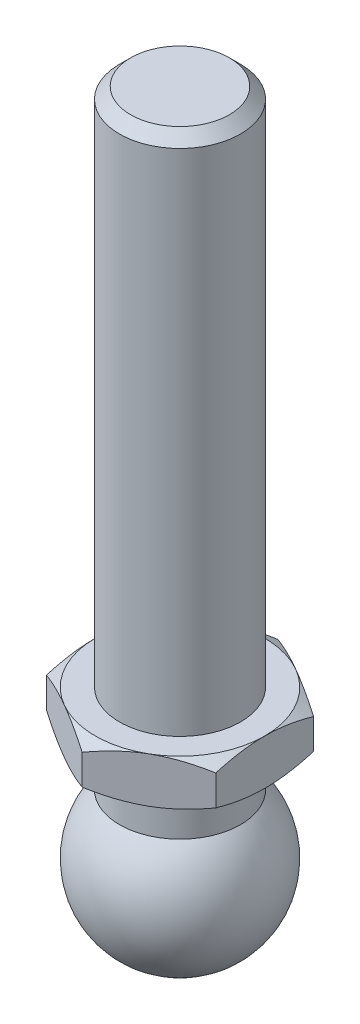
ISO-10303-21;
HEADER;
FILE_DESCRIPTION(('STEP AP214'),'2;1');
FILE_NAME('part.step','',(''),(''),'','','');
FILE_SCHEMA(('AUTOMOTIVE_DESIGN { 1 0 10303 214 1 1 1 1 }'));
ENDSEC;
DATA;
#1=APPLICATION_CONTEXT('core data for automotive mechanical design processes');
#2=APPLICATION_PROTOCOL_DEFINITION('international standard','automotive_design',2000,#1);
#3=PRODUCT_CONTEXT('',#1,'mechanical');
#4=PRODUCT('Part','Part','',(#3));
#5=PRODUCT_RELATED_PRODUCT_CATEGORY('part','',(#4));
#6=PRODUCT_DEFINITION_FORMATION('','',#4);
#7=PRODUCT_DEFINITION_CONTEXT('part definition',#1,'design');
#8=PRODUCT_DEFINITION('design','',#6,#7);
#9=PRODUCT_DEFINITION_SHAPE('','',#8);
#10=(LENGTH_UNIT() NAMED_UNIT(*) SI_UNIT(.MILLI.,.METRE.));
#11=(NAMED_UNIT(*) PLANE_ANGLE_UNIT() SI_UNIT($,.RADIAN.));
#12=(NAMED_UNIT(*) SI_UNIT($,.STERADIAN.) SOLID_ANGLE_UNIT());
#13=UNCERTAINTY_MEASURE_WITH_UNIT(LENGTH_MEASURE(1.E-05),#10,'distance_accuracy_value','');
#14=(GEOMETRIC_REPRESENTATION_CONTEXT(3) GLOBAL_UNCERTAINTY_ASSIGNED_CONTEXT((#13)) GLOBAL_UNIT_ASSIGNED_CONTEXT((#10,
#11,#12)) REPRESENTATION_CONTEXT('',''));
#15=CARTESIAN_POINT('',(0.,0.,0.));
#16=DIRECTION('',(0.,0.,1.));
#17=DIRECTION('',(1.,0.,0.));
#18=AXIS2_PLACEMENT_3D('',#15,#16,#17);
#19=CARTESIAN_POINT('',(0.,12.25,0.));
#20=DIRECTION('',(0.,-1.,0.));
#21=DIRECTION('',(0.,0.,-1.));
#22=AXIS2_PLACEMENT_3D('',#19,#20,#21);
#23=CONICAL_SURFACE('',#22,7.,1.0471975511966);
#24=CARTESIAN_POINT('',(-7.,8.18828268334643,12.1648696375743));
#25=CARTESIAN_POINT('',(-7.,8.33391573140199,11.8738003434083));
#26=CARTESIAN_POINT('',(-7.,8.47854589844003,11.5822239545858));
#27=CARTESIAN_POINT('',(-7.,8.76531569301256,10.997825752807));
#28=CARTESIAN_POINT('',(-7.,8.90745515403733,10.7050038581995));
#29=CARTESIAN_POINT('',(-7.,9.18902214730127,10.117331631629));
#30=CARTESIAN_POINT('',(-7.,9.32844364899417,9.8224784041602));
#31=CARTESIAN_POINT('',(-7.,9.60360604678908,9.23106328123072));
#32=CARTESIAN_POINT('',(-7.,9.73934701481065,8.93450141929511));
#33=CARTESIAN_POINT('',(-7.,10.0123110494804,8.32593520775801));
#34=CARTESIAN_POINT('',(-7.,10.1493254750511,8.0138369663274));
#35=CARTESIAN_POINT('',(-7.,10.4171383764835,7.38695797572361));
#36=CARTESIAN_POINT('',(-7.,10.5479365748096,7.07217710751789));
#37=CARTESIAN_POINT('',(-7.,10.8015530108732,6.43962449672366));
#38=CARTESIAN_POINT('',(-7.,10.924376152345,6.12185473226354));
#39=CARTESIAN_POINT('',(-7.,11.1599016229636,5.4826031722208));
#40=CARTESIAN_POINT('',(-7.,11.2726050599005,5.16112178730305));
#41=CARTESIAN_POINT('',(-7.,11.5099014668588,4.43821731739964));
#42=CARTESIAN_POINT('',(-7.,11.631118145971,4.03566892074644));
#43=CARTESIAN_POINT('',(-7.,11.8469740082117,3.22331060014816));
#44=CARTESIAN_POINT('',(-7.,11.9416155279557,2.81350131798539));
#45=CARTESIAN_POINT('',(-7.,12.0569999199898,2.1974256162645));
#46=CARTESIAN_POINT('',(-7.,12.0908518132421,1.99359214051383));
#47=CARTESIAN_POINT('',(-7.,12.1493191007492,1.58461613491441));
#48=CARTESIAN_POINT('',(-7.,12.1739358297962,1.37947379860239));
#49=CARTESIAN_POINT('',(-7.,12.2131968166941,0.968289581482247));
#50=CARTESIAN_POINT('',(-7.,12.2278439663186,0.762247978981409));
#51=CARTESIAN_POINT('',(-7.,12.2467021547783,0.349683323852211));
#52=CARTESIAN_POINT('',(-7.,12.2509132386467,0.143160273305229));
#53=CARTESIAN_POINT('',(-7.,12.2487493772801,-0.271082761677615));
#54=CARTESIAN_POINT('',(-7.,12.2423100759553,-0.47880240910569));
#55=CARTESIAN_POINT('',(-7.,12.2189433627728,-0.893645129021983));
#56=CARTESIAN_POINT('',(-7.,12.2020159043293,-1.10076819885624));
#57=CARTESIAN_POINT('',(-7.,12.1582124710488,-1.5140304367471));
#58=CARTESIAN_POINT('',(-7.,12.1313327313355,-1.72016920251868));
#59=CARTESIAN_POINT('',(-7.,12.0684180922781,-2.13103319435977));
#60=CARTESIAN_POINT('',(-7.,12.0323828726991,-2.33575837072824));
#61=CARTESIAN_POINT('',(-7.,11.9105686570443,-2.95437912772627));
#62=CARTESIAN_POINT('',(-7.,11.8118729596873,-3.36575077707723));
#63=CARTESIAN_POINT('',(-7.,11.5884533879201,-4.18138012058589));
#64=CARTESIAN_POINT('',(-7.,11.4637148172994,-4.58563365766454));
#65=CARTESIAN_POINT('',(-7.,11.2233248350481,-5.30320893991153));
#66=CARTESIAN_POINT('',(-7.,11.1112875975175,-5.6177595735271));
#67=CARTESIAN_POINT('',(-7.,10.8778514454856,-6.24325021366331));
#68=CARTESIAN_POINT('',(-7.,10.7564551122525,-6.55419118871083));
#69=CARTESIAN_POINT('',(-7.,10.5062070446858,-7.17328528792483));
#70=CARTESIAN_POINT('',(-7.,10.3773503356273,-7.48143638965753));
#71=CARTESIAN_POINT('',(-7.,10.1137823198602,-8.09523802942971));
#72=CARTESIAN_POINT('',(-7.,9.97907065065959,-8.40088841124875));
#73=CARTESIAN_POINT('',(-7.,9.71078407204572,-8.99716345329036));
#74=CARTESIAN_POINT('',(-7.,9.57740317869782,-9.2878756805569));
#75=CARTESIAN_POINT('',(-7.,9.30714715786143,-9.86766295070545));
#76=CARTESIAN_POINT('',(-7.,9.17027208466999,-10.1567380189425));
#77=CARTESIAN_POINT('',(-7.,8.89389786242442,-10.7329937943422));
#78=CARTESIAN_POINT('',(-7.,8.75440383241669,-11.0201769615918));
#79=CARTESIAN_POINT('',(-7.,8.47302286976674,-11.5933594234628));
#80=CARTESIAN_POINT('',(-7.,8.33113600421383,-11.879358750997));
#81=CARTESIAN_POINT('',(-7.,8.18828268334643,-12.1648696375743));
#82=B_SPLINE_CURVE_WITH_KNOTS('',3,(#24,#25,#26,#27,#28,#29,#30,#31,#32,#33,#34,#35,#36,#37,#38,
#39,#40,#41,#42,#43,#44,#45,#46,#47,#48,#49,#50,#51,#52,#53,#54,#55,#56,#57,#58,#59,#60,#61,#62,
#63,#64,#65,#66,#67,#68,#69,#70,#71,#72,#73,#74,#75,#76,#77,#78,#79,#80,#81),.UNSPECIFIED.,.F.,
.F.,(4,2,2,2,2,2,2,2,2,2,2,2,2,2,2,2,2,2,2,2,2,2,2,2,2,2,2,2,4),(0.,0.976413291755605,
1.95289161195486,2.93133423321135,3.90975772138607,4.93225217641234,5.95479223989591,
6.97669748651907,7.99849072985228,9.25906449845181,10.5195273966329,11.1392271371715,
11.7588372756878,12.3782676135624,12.9976952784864,13.6208795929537,14.2440666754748,
14.8674897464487,15.490934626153,16.7587972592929,18.027377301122,19.0289263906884,
20.0302002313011,21.0321496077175,22.0341611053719,22.9936838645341,23.9531917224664,
24.9109871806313,25.8687558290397),.UNSPECIFIED.);
#83=CARTESIAN_POINT('',(-7.,11.6247852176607,4.04145188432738));
#84=VERTEX_POINT('',#83);
#85=CARTESIAN_POINT('',(-7.,12.25,0.));
#86=VERTEX_POINT('',#85);
#87=EDGE_CURVE('E312',#84,#86,#82,.T.);
#88=ORIENTED_EDGE('',*,*,#87,.F.);
#89=CARTESIAN_POINT('',(0.0002,11.6247185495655,8.0830192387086));
#90=CARTESIAN_POINT('',(-0.153667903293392,11.6760001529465,7.99418356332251));
#91=CARTESIAN_POINT('',(-0.30810950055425,11.7249544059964,7.90501666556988));
#92=CARTESIAN_POINT('',(-0.618246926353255,11.8175672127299,7.72595873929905));
#93=CARTESIAN_POINT('',(-0.773943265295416,11.8612234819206,7.63606741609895));
#94=CARTESIAN_POINT('',(-1.24352516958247,11.9833884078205,7.36495417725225));
#95=CARTESIAN_POINT('',(-1.5592643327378,12.052874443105,7.18266208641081));
#96=CARTESIAN_POINT('',(-2.03176224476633,12.1343550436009,6.9098652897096));
#97=CARTESIAN_POINT('',(-2.18710922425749,12.1575665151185,6.82017566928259));
#98=CARTESIAN_POINT('',(-2.49850511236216,12.1964887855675,6.64039116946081));
#99=CARTESIAN_POINT('',(-2.65455395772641,12.2122002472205,6.55029632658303));
#100=CARTESIAN_POINT('',(-2.96692267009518,12.2357220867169,6.36995016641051));
#101=CARTESIAN_POINT('',(-3.12324202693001,12.2435414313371,6.27969914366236));
#102=CARTESIAN_POINT('',(-3.43601650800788,12.2511197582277,6.09911871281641));
#103=CARTESIAN_POINT('',(-3.59247162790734,12.250878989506,6.00878930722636));
#104=CARTESIAN_POINT('',(-4.02110687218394,12.2391402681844,5.76131663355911));
#105=CARTESIAN_POINT('',(-4.2931466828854,12.2194342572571,5.60425437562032));
#106=CARTESIAN_POINT('',(-4.8354194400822,12.1569465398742,5.29117305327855));
#107=CARTESIAN_POINT('',(-5.10565047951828,12.114143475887,5.13515508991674));
#108=CARTESIAN_POINT('',(-5.64901454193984,12.0071483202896,4.82144370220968));
#109=CARTESIAN_POINT('',(-5.92207900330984,11.9425029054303,4.66378986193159));
#110=CARTESIAN_POINT('',(-6.46413578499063,11.795783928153,4.35083323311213));
#111=CARTESIAN_POINT('',(-6.73313504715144,11.7137448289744,4.19552643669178));
#112=CARTESIAN_POINT('',(-7.0002,11.6247185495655,4.04133641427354));
#113=B_SPLINE_CURVE_WITH_KNOTS('',3,(#89,#90,#91,#92,#93,#94,#95,#96,#97,#98,#99,#100,#101,#102,
#103,#104,#105,#106,#107,#108,#109,#110,#111,#112),.UNSPECIFIED.,.F.,.F.,(4,2,2,2,2,2,2,2,2,2,2,
4),(0.,0.554727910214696,1.10969417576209,2.2219327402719,2.76443041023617,3.30688013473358,
3.8487128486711,4.3905288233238,5.33376515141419,6.27787517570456,7.2429241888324,
8.20607866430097),.UNSPECIFIED.);
#114=CARTESIAN_POINT('',(-3.5,12.25,6.06217782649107));
#115=VERTEX_POINT('',#114);
#116=EDGE_CURVE('E138',#115,#84,#113,.T.);
#117=ORIENTED_EDGE('',*,*,#116,.F.);
#118=CARTESIAN_POINT('',(0.,12.25,0.));
#119=DIRECTION('',(0.,-1.,0.));
#120=DIRECTION('',(0.,0.,-1.));
#121=AXIS2_PLACEMENT_3D('',#118,#119,#120);
#122=CIRCLE('',#121,7.);
#123=EDGE_CURVE('E286',#115,#86,#122,.T.);
#124=ORIENTED_EDGE('',*,*,#123,.T.);
#125=EDGE_LOOP('',(#88,#117,#124));
#126=FACE_BOUND('',#125,.T.);
#127=ADVANCED_FACE('F17',(#126),#23,.T.);
#128=CARTESIAN_POINT('',(-7.,11.6247852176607,-4.04145188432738));
#129=VERTEX_POINT('',#128);
#130=EDGE_CURVE('E196',#86,#129,#82,.T.);
#131=ORIENTED_EDGE('',*,*,#130,.F.);
#132=CARTESIAN_POINT('',(-3.5,12.25,-6.06217782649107));
#133=VERTEX_POINT('',#132);
#134=EDGE_CURVE('E198',#86,#133,#122,.T.);
#135=ORIENTED_EDGE('',*,*,#134,.T.);
#136=CARTESIAN_POINT('',(-7.0002,11.6247185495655,-4.04133641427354));
#137=CARTESIAN_POINT('',(-6.84633209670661,11.6760001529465,-4.13017208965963));
#138=CARTESIAN_POINT('',(-6.69189049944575,11.7249544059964,-4.21933898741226));
#139=CARTESIAN_POINT('',(-6.38175307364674,11.8175672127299,-4.39839691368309));
#140=CARTESIAN_POINT('',(-6.22605673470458,11.8612234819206,-4.48828823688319));
#141=CARTESIAN_POINT('',(-5.75647483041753,11.9833884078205,-4.75940147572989));
#142=CARTESIAN_POINT('',(-5.4407356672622,12.052874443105,-4.94169356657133));
#143=CARTESIAN_POINT('',(-4.96823775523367,12.1343550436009,-5.21449036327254));
#144=CARTESIAN_POINT('',(-4.81289077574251,12.1575665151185,-5.30417998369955));
#145=CARTESIAN_POINT('',(-4.50149488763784,12.1964887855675,-5.48396448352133));
#146=CARTESIAN_POINT('',(-4.34544604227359,12.2122002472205,-5.57405932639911));
#147=CARTESIAN_POINT('',(-4.03307732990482,12.2357220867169,-5.75440548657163));
#148=CARTESIAN_POINT('',(-3.87675797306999,12.2435414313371,-5.84465650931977));
#149=CARTESIAN_POINT('',(-3.56398349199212,12.2511197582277,-6.02523694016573));
#150=CARTESIAN_POINT('',(-3.40752837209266,12.250878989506,-6.11556634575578));
#151=CARTESIAN_POINT('',(-2.97889312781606,12.2391402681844,-6.36303901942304));
#152=CARTESIAN_POINT('',(-2.7068533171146,12.2194342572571,-6.52010127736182));
#153=CARTESIAN_POINT('',(-2.1645805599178,12.1569465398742,-6.83318259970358));
#154=CARTESIAN_POINT('',(-1.89434952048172,12.114143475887,-6.9892005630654));
#155=CARTESIAN_POINT('',(-1.35098545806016,12.0071483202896,-7.30291195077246));
#156=CARTESIAN_POINT('',(-1.07792099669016,11.9425029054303,-7.46056579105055));
#157=CARTESIAN_POINT('',(-0.53586421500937,11.795783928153,-7.77352241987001));
#158=CARTESIAN_POINT('',(-0.266864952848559,11.7137448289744,-7.92882921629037));
#159=CARTESIAN_POINT('',(0.000200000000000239,11.6247185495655,-8.0830192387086));
#160=B_SPLINE_CURVE_WITH_KNOTS('',3,(#136,#137,#138,#139,#140,#141,#142,#143,#144,#145,#146,
#147,#148,#149,#150,#151,#152,#153,#154,#155,#156,#157,#158,#159),.UNSPECIFIED.,.F.,.F.,(4,2,2,
2,2,2,2,2,2,2,2,4),(0.,0.554727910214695,1.10969417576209,2.2219327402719,2.76443041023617,
3.30688013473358,3.8487128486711,4.39052882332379,5.33376515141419,6.27787517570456,
7.2429241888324,8.20607866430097),.UNSPECIFIED.);
#161=EDGE_CURVE('E186',#129,#133,#160,.T.);
#162=ORIENTED_EDGE('',*,*,#161,.F.);
#163=EDGE_LOOP('',(#131,#135,#162));
#164=FACE_BOUND('',#163,.T.);
#165=ADVANCED_FACE('F195',(#164),#23,.T.);
#166=CARTESIAN_POINT('',(0.,11.6247852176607,-8.08290376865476));
#167=VERTEX_POINT('',#166);
#168=EDGE_CURVE('E200',#133,#167,#160,.T.);
#169=ORIENTED_EDGE('',*,*,#168,.F.);
#170=CARTESIAN_POINT('',(3.5,12.25,-6.06217782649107));
#171=VERTEX_POINT('',#170);
#172=EDGE_CURVE('E296',#133,#171,#122,.T.);
#173=ORIENTED_EDGE('',*,*,#172,.T.);
#174=CARTESIAN_POINT('',(-0.0002,11.6247185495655,-8.0830192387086));
#175=CARTESIAN_POINT('',(0.153667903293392,11.6760001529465,-7.99418356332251));
#176=CARTESIAN_POINT('',(0.30810950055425,11.7249544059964,-7.90501666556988));
#177=CARTESIAN_POINT('',(0.618246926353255,11.8175672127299,-7.72595873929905));
#178=CARTESIAN_POINT('',(0.773943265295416,11.8612234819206,-7.63606741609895));
#179=CARTESIAN_POINT('',(1.24352516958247,11.9833884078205,-7.36495417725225));
#180=CARTESIAN_POINT('',(1.5592643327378,12.052874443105,-7.18266208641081));
#181=CARTESIAN_POINT('',(2.03176224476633,12.1343550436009,-6.9098652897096));
#182=CARTESIAN_POINT('',(2.18710922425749,12.1575665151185,-6.82017566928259));
#183=CARTESIAN_POINT('',(2.49850511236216,12.1964887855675,-6.64039116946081));
#184=CARTESIAN_POINT('',(2.65455395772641,12.2122002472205,-6.55029632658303));
#185=CARTESIAN_POINT('',(2.96692267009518,12.2357220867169,-6.36995016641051));
#186=CARTESIAN_POINT('',(3.12324202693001,12.2435414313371,-6.27969914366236));
#187=CARTESIAN_POINT('',(3.43601650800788,12.2511197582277,-6.09911871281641));
#188=CARTESIAN_POINT('',(3.59247162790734,12.250878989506,-6.00878930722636));
#189=CARTESIAN_POINT('',(4.02110687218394,12.2391402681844,-5.76131663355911));
#190=CARTESIAN_POINT('',(4.2931466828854,12.2194342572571,-5.60425437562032));
#191=CARTESIAN_POINT('',(4.8354194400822,12.1569465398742,-5.29117305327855));
#192=CARTESIAN_POINT('',(5.10565047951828,12.114143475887,-5.13515508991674));
#193=CARTESIAN_POINT('',(5.64901454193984,12.0071483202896,-4.82144370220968));
#194=CARTESIAN_POINT('',(5.92207900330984,11.9425029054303,-4.66378986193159));
#195=CARTESIAN_POINT('',(6.46413578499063,11.795783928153,-4.35083323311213));
#196=CARTESIAN_POINT('',(6.73313504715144,11.7137448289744,-4.19552643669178));
#197=CARTESIAN_POINT('',(7.0002,11.6247185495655,-4.04133641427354));
#198=B_SPLINE_CURVE_WITH_KNOTS('',3,(#174,#175,#176,#177,#178,#179,#180,#181,#182,#183,#184,
#185,#186,#187,#188,#189,#190,#191,#192,#193,#194,#195,#196,#197),.UNSPECIFIED.,.F.,.F.,(4,2,2,
2,2,2,2,2,2,2,2,4),(0.,0.554727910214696,1.10969417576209,2.2219327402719,2.76443041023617,
3.30688013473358,3.8487128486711,4.3905288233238,5.33376515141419,6.27787517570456,
7.2429241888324,8.20607866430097),.UNSPECIFIED.);
#199=EDGE_CURVE('E246',#167,#171,#198,.T.);
#200=ORIENTED_EDGE('',*,*,#199,.F.);
#201=EDGE_LOOP('',(#169,#173,#200));
#202=FACE_BOUND('',#201,.T.);
#203=ADVANCED_FACE('F345',(#202),#23,.T.);
#204=CARTESIAN_POINT('',(7.,11.6247852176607,-4.04145188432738));
#205=VERTEX_POINT('',#204);
#206=EDGE_CURVE('E241',#171,#205,#198,.T.);
#207=ORIENTED_EDGE('',*,*,#206,.F.);
#208=CARTESIAN_POINT('',(7.,12.25,0.));
#209=VERTEX_POINT('',#208);
#210=EDGE_CURVE('E291',#171,#209,#122,.T.);
#211=ORIENTED_EDGE('',*,*,#210,.T.);
#212=CARTESIAN_POINT('',(7.,8.18828268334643,-12.1648696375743));
#213=CARTESIAN_POINT('',(7.,8.33391573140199,-11.8738003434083));
#214=CARTESIAN_POINT('',(7.,8.47854589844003,-11.5822239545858));
#215=CARTESIAN_POINT('',(7.,8.76531569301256,-10.997825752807));
#216=CARTESIAN_POINT('',(7.,8.90745515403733,-10.7050038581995));
#217=CARTESIAN_POINT('',(7.,9.18902214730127,-10.117331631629));
#218=CARTESIAN_POINT('',(7.,9.32844364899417,-9.8224784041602));
#219=CARTESIAN_POINT('',(7.,9.60360604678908,-9.23106328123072));
#220=CARTESIAN_POINT('',(7.,9.73934701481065,-8.93450141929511));
#221=CARTESIAN_POINT('',(7.,10.0123110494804,-8.32593520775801));
#222=CARTESIAN_POINT('',(7.,10.1493254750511,-8.0138369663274));
#223=CARTESIAN_POINT('',(7.,10.4171383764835,-7.38695797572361));
#224=CARTESIAN_POINT('',(7.,10.5479365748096,-7.07217710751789));
#225=CARTESIAN_POINT('',(7.,10.8015530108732,-6.43962449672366));
#226=CARTESIAN_POINT('',(7.,10.924376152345,-6.12185473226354));
#227=CARTESIAN_POINT('',(7.,11.1599016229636,-5.4826031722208));
#228=CARTESIAN_POINT('',(7.,11.2726050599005,-5.16112178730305));
#229=CARTESIAN_POINT('',(7.,11.5099014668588,-4.43821731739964));
#230=CARTESIAN_POINT('',(7.,11.631118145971,-4.03566892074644));
#231=CARTESIAN_POINT('',(7.,11.8469740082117,-3.22331060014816));
#232=CARTESIAN_POINT('',(7.,11.9416155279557,-2.81350131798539));
#233=CARTESIAN_POINT('',(7.,12.0569999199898,-2.1974256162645));
#234=CARTESIAN_POINT('',(7.,12.0908518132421,-1.99359214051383));
#235=CARTESIAN_POINT('',(7.,12.1493191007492,-1.58461613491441));
#236=CARTESIAN_POINT('',(7.,12.1739358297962,-1.37947379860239));
#237=CARTESIAN_POINT('',(7.,12.2131968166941,-0.968289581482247));
#238=CARTESIAN_POINT('',(7.,12.2278439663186,-0.762247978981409));
#239=CARTESIAN_POINT('',(7.,12.2467021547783,-0.349683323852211));
#240=CARTESIAN_POINT('',(7.,12.2509132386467,-0.143160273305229));
#241=CARTESIAN_POINT('',(7.,12.2487493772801,0.271082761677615));
#242=CARTESIAN_POINT('',(7.,12.2423100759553,0.47880240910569));
#243=CARTESIAN_POINT('',(7.,12.2189433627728,0.893645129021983));
#244=CARTESIAN_POINT('',(7.,12.2020159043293,1.10076819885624));
#245=CARTESIAN_POINT('',(7.,12.1582124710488,1.5140304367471));
#246=CARTESIAN_POINT('',(7.,12.1313327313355,1.72016920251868));
#247=CARTESIAN_POINT('',(7.,12.0684180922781,2.13103319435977));
#248=CARTESIAN_POINT('',(7.,12.0323828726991,2.33575837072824));
#249=CARTESIAN_POINT('',(7.,11.9105686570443,2.95437912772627));
#250=CARTESIAN_POINT('',(7.,11.8118729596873,3.36575077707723));
#251=CARTESIAN_POINT('',(7.,11.5884533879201,4.18138012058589));
#252=CARTESIAN_POINT('',(7.,11.4637148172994,4.58563365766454));
#253=CARTESIAN_POINT('',(7.,11.2233248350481,5.30320893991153));
#254=CARTESIAN_POINT('',(7.,11.1112875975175,5.6177595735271));
#255=CARTESIAN_POINT('',(7.,10.8778514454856,6.24325021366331));
#256=CARTESIAN_POINT('',(7.,10.7564551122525,6.55419118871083));
#257=CARTESIAN_POINT('',(7.,10.5062070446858,7.17328528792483));
#258=CARTESIAN_POINT('',(7.,10.3773503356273,7.48143638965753));
#259=CARTESIAN_POINT('',(7.,10.1137823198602,8.09523802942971));
#260=CARTESIAN_POINT('',(7.,9.97907065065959,8.40088841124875));
#261=CARTESIAN_POINT('',(7.,9.71078407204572,8.99716345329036));
#262=CARTESIAN_POINT('',(7.,9.57740317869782,9.2878756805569));
#263=CARTESIAN_POINT('',(7.,9.30714715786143,9.86766295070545));
#264=CARTESIAN_POINT('',(7.,9.17027208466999,10.1567380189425));
#265=CARTESIAN_POINT('',(7.,8.89389786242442,10.7329937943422));
#266=CARTESIAN_POINT('',(7.,8.75440383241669,11.0201769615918));
#267=CARTESIAN_POINT('',(7.,8.47302286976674,11.5933594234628));
#268=CARTESIAN_POINT('',(7.,8.33113600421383,11.879358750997));
#269=CARTESIAN_POINT('',(7.,8.18828268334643,12.1648696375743));
#270=B_SPLINE_CURVE_WITH_KNOTS('',3,(#212,#213,#214,#215,#216,#217,#218,#219,#220,#221,#222,
#223,#224,#225,#226,#227,#228,#229,#230,#231,#232,#233,#234,#235,#236,#237,#238,#239,#240,#241,
#242,#243,#244,#245,#246,#247,#248,#249,#250,#251,#252,#253,#254,#255,#256,#257,#258,#259,#260,
#261,#262,#263,#264,#265,#266,#267,#268,#269),.UNSPECIFIED.,.F.,.F.,(4,2,2,2,2,2,2,2,2,2,2,2,2,
2,2,2,2,2,2,2,2,2,2,2,2,2,2,2,4),(0.,0.976413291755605,1.95289161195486,2.93133423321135,
3.90975772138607,4.93225217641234,5.95479223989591,6.97669748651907,7.99849072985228,
9.25906449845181,10.5195273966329,11.1392271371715,11.7588372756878,12.3782676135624,
12.9976952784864,13.6208795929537,14.2440666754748,14.8674897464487,15.490934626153,
16.7587972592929,18.027377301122,19.0289263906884,20.0302002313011,21.0321496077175,
22.0341611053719,22.9936838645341,23.9531917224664,24.9109871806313,25.8687558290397),.UNSPECIFIED.);
#271=EDGE_CURVE('E252',#205,#209,#270,.T.);
#272=ORIENTED_EDGE('',*,*,#271,.F.);
#273=EDGE_LOOP('',(#207,#211,#272));
#274=FACE_BOUND('',#273,.T.);
#275=ADVANCED_FACE('F355',(#274),#23,.T.);
#276=CARTESIAN_POINT('',(7.,11.6247852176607,4.04145188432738));
#277=VERTEX_POINT('',#276);
#278=EDGE_CURVE('E254',#209,#277,#270,.T.);
#279=ORIENTED_EDGE('',*,*,#278,.F.);
#280=CARTESIAN_POINT('',(3.5,12.25,6.06217782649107));
#281=VERTEX_POINT('',#280);
#282=EDGE_CURVE('E284',#209,#281,#122,.T.);
#283=ORIENTED_EDGE('',*,*,#282,.T.);
#284=CARTESIAN_POINT('',(7.0002,11.6247185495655,4.04133641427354));
#285=CARTESIAN_POINT('',(6.84633209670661,11.6760001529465,4.13017208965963));
#286=CARTESIAN_POINT('',(6.69189049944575,11.7249544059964,4.21933898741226));
#287=CARTESIAN_POINT('',(6.38175307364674,11.8175672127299,4.39839691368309));
#288=CARTESIAN_POINT('',(6.22605673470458,11.8612234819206,4.48828823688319));
#289=CARTESIAN_POINT('',(5.75647483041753,11.9833884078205,4.75940147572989));
#290=CARTESIAN_POINT('',(5.4407356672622,12.052874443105,4.94169356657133));
#291=CARTESIAN_POINT('',(4.96823775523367,12.1343550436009,5.21449036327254));
#292=CARTESIAN_POINT('',(4.81289077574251,12.1575665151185,5.30417998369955));
#293=CARTESIAN_POINT('',(4.50149488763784,12.1964887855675,5.48396448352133));
#294=CARTESIAN_POINT('',(4.34544604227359,12.2122002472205,5.57405932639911));
#295=CARTESIAN_POINT('',(4.03307732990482,12.2357220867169,5.75440548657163));
#296=CARTESIAN_POINT('',(3.87675797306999,12.2435414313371,5.84465650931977));
#297=CARTESIAN_POINT('',(3.56398349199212,12.2511197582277,6.02523694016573));
#298=CARTESIAN_POINT('',(3.40752837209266,12.250878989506,6.11556634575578));
#299=CARTESIAN_POINT('',(2.97889312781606,12.2391402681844,6.36303901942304));
#300=CARTESIAN_POINT('',(2.7068533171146,12.2194342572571,6.52010127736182));
#301=CARTESIAN_POINT('',(2.1645805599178,12.1569465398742,6.83318259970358));
#302=CARTESIAN_POINT('',(1.89434952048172,12.114143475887,6.9892005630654));
#303=CARTESIAN_POINT('',(1.35098545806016,12.0071483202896,7.30291195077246));
#304=CARTESIAN_POINT('',(1.07792099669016,11.9425029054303,7.46056579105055));
#305=CARTESIAN_POINT('',(0.53586421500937,11.795783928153,7.77352241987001));
#306=CARTESIAN_POINT('',(0.266864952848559,11.7137448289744,7.92882921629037));
#307=CARTESIAN_POINT('',(-0.000200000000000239,11.6247185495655,8.0830192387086));
#308=B_SPLINE_CURVE_WITH_KNOTS('',3,(#284,#285,#286,#287,#288,#289,#290,#291,#292,#293,#294,
#295,#296,#297,#298,#299,#300,#301,#302,#303,#304,#305,#306,#307),.UNSPECIFIED.,.F.,.F.,(4,2,2,
2,2,2,2,2,2,2,2,4),(0.,0.554727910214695,1.10969417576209,2.2219327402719,2.76443041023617,
3.30688013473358,3.8487128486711,4.39052882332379,5.33376515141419,6.27787517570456,
7.2429241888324,8.20607866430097),.UNSPECIFIED.);
#309=EDGE_CURVE('E129',#277,#281,#308,.T.);
#310=ORIENTED_EDGE('',*,*,#309,.F.);
#311=EDGE_LOOP('',(#279,#283,#310));
#312=FACE_BOUND('',#311,.T.);
#313=ADVANCED_FACE('F288',(#312),#23,.T.);
#314=CARTESIAN_POINT('',(0.,11.6247852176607,8.08290376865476));
#315=VERTEX_POINT('',#314);
#316=EDGE_CURVE('E119',#281,#315,#308,.T.);
#317=ORIENTED_EDGE('',*,*,#316,.F.);
#318=EDGE_CURVE('E277',#281,#115,#122,.T.);
#319=ORIENTED_EDGE('',*,*,#318,.T.);
#320=EDGE_CURVE('E32',#315,#115,#113,.T.);
#321=ORIENTED_EDGE('',*,*,#320,.F.);
#322=EDGE_LOOP('',(#317,#319,#321));
#323=FACE_BOUND('',#322,.T.);
#324=ADVANCED_FACE('F276',(#323),#23,.T.);
#325=CARTESIAN_POINT('',(0.,55.25,0.));
#326=DIRECTION('',(0.,-1.,0.));
#327=DIRECTION('',(0.,0.,-1.));
#328=AXIS2_PLACEMENT_3D('',#325,#326,#327);
#329=PLANE('',#328);
#330=CARTESIAN_POINT('',(0.,55.25,0.));
#331=DIRECTION('',(0.,-1.,0.));
#332=DIRECTION('',(0.,0.,-1.));
#333=AXIS2_PLACEMENT_3D('',#330,#331,#332);
#334=CIRCLE('',#333,4.08);
#335=CARTESIAN_POINT('',(0.,55.25,-4.08));
#336=VERTEX_POINT('',#335);
#337=EDGE_CURVE('E25',#336,#336,#334,.T.);
#338=ORIENTED_EDGE('',*,*,#337,.F.);
#339=EDGE_LOOP('',(#338));
#340=FACE_BOUND('',#339,.T.);
#341=ADVANCED_FACE('F19',(#340),#329,.F.);
#342=CARTESIAN_POINT('',(0.,55.25,0.));
#343=DIRECTION('',(0.,-1.,0.));
#344=DIRECTION('',(0.,0.,-1.));
#345=AXIS2_PLACEMENT_3D('',#342,#343,#344);
#346=CONICAL_SURFACE('',#345,4.08,0.785398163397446);
#347=CARTESIAN_POINT('',(0.,54.33,0.));
#348=DIRECTION('',(0.,-1.,0.));
#349=DIRECTION('',(0.,0.,-1.));
#350=AXIS2_PLACEMENT_3D('',#347,#348,#349);
#351=CIRCLE('',#350,5.);
#352=CARTESIAN_POINT('',(0.,54.33,-5.));
#353=VERTEX_POINT('',#352);
#354=EDGE_CURVE('E293',#353,#353,#351,.T.);
#355=ORIENTED_EDGE('',*,*,#354,.F.);
#356=EDGE_LOOP('',(#355));
#357=FACE_BOUND('',#356,.T.);
#358=ORIENTED_EDGE('',*,*,#337,.T.);
#359=EDGE_LOOP('',(#358));
#360=FACE_BOUND('',#359,.T.);
#361=ADVANCED_FACE('F353',(#357,#360),#346,.T.);
#362=CARTESIAN_POINT('',(0.,-7.,0.));
#363=DIRECTION('',(0.,-1.,0.));
#364=DIRECTION('',(0.,0.,-1.));
#365=AXIS2_PLACEMENT_3D('',#362,#363,#364);
#366=CYLINDRICAL_SURFACE('',#365,5.);
#367=CARTESIAN_POINT('',(0.,12.25,0.));
#368=DIRECTION('',(0.,-1.,0.));
#369=DIRECTION('',(0.,0.,-1.));
#370=AXIS2_PLACEMENT_3D('',#367,#368,#369);
#371=CIRCLE('',#370,5.);
#372=CARTESIAN_POINT('',(0.,12.25,-5.));
#373=VERTEX_POINT('',#372);
#374=EDGE_CURVE('E290',#373,#373,#371,.T.);
#375=ORIENTED_EDGE('',*,*,#374,.F.);
#376=EDGE_LOOP('',(#375));
#377=FACE_BOUND('',#376,.T.);
#378=ORIENTED_EDGE('',*,*,#354,.T.);
#379=EDGE_LOOP('',(#378));
#380=FACE_BOUND('',#379,.T.);
#381=ADVANCED_FACE('F430',(#377,#380),#366,.T.);
#382=CARTESIAN_POINT('',(5.,12.25,0.));
#383=DIRECTION('',(0.,-1.,0.));
#384=DIRECTION('',(0.,0.,-1.));
#385=AXIS2_PLACEMENT_3D('',#382,#383,#384);
#386=PLANE('',#385);
#387=ORIENTED_EDGE('',*,*,#282,.F.);
#388=ORIENTED_EDGE('',*,*,#210,.F.);
#389=ORIENTED_EDGE('',*,*,#172,.F.);
#390=ORIENTED_EDGE('',*,*,#134,.F.);
#391=ORIENTED_EDGE('',*,*,#123,.F.);
#392=ORIENTED_EDGE('',*,*,#318,.F.);
#393=EDGE_LOOP('',(#387,#388,#389,#390,#391,#392));
#394=FACE_BOUND('',#393,.T.);
#395=ORIENTED_EDGE('',*,*,#374,.T.);
#396=EDGE_LOOP('',(#395));
#397=FACE_BOUND('',#396,.T.);
#398=ADVANCED_FACE('F281',(#394,#397),#386,.F.);
#399=CARTESIAN_POINT('',(-7.,8.5,-4.04145188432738));
#400=DIRECTION('',(-1.,0.,0.));
#401=DIRECTION('',(0.,0.,1.));
#402=AXIS2_PLACEMENT_3D('',#399,#400,#401);
#403=PLANE('',#402);
#404=ORIENTED_EDGE('',*,*,#87,.T.);
#405=ORIENTED_EDGE('',*,*,#130,.T.);
#406=DIRECTION('',(0.,1.,0.));
#407=VECTOR('',#406,1.);
#408=CARTESIAN_POINT('',(-7.,8.5,-4.04145188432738));
#409=LINE('',#408,#407);
#410=CARTESIAN_POINT('',(-7.,9.12521478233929,-4.04145188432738));
#411=VERTEX_POINT('',#410);
#412=EDGE_CURVE('E112',#411,#129,#409,.T.);
#413=ORIENTED_EDGE('',*,*,#412,.F.);
#414=CARTESIAN_POINT('',(-7.,12.5617173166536,-12.1648696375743));
#415=CARTESIAN_POINT('',(-7.,12.416084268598,-11.8738003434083));
#416=CARTESIAN_POINT('',(-7.,12.27145410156,-11.5822239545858));
#417=CARTESIAN_POINT('',(-7.,11.9846843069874,-10.997825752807));
#418=CARTESIAN_POINT('',(-7.,11.8425448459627,-10.7050038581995));
#419=CARTESIAN_POINT('',(-7.,11.5609778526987,-10.1173316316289));
#420=CARTESIAN_POINT('',(-7.,11.4215563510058,-9.82247840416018));
#421=CARTESIAN_POINT('',(-7.,11.1463939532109,-9.23106328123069));
#422=CARTESIAN_POINT('',(-7.,11.0106529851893,-8.93450141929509));
#423=CARTESIAN_POINT('',(-7.,10.7376889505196,-8.32593520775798));
#424=CARTESIAN_POINT('',(-7.,10.6006745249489,-8.01383696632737));
#425=CARTESIAN_POINT('',(-7.,10.3328616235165,-7.38695797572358));
#426=CARTESIAN_POINT('',(-7.,10.2020634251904,-7.07217710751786));
#427=CARTESIAN_POINT('',(-7.,9.94844698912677,-6.43962449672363));
#428=CARTESIAN_POINT('',(-7.,9.825623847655,-6.12185473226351));
#429=CARTESIAN_POINT('',(-7.,9.59009837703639,-5.48260317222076));
#430=CARTESIAN_POINT('',(-7.,9.47739494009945,-5.16112178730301));
#431=CARTESIAN_POINT('',(-7.,9.24009853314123,-4.4382173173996));
#432=CARTESIAN_POINT('',(-7.,9.11888185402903,-4.03566892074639));
#433=CARTESIAN_POINT('',(-7.,8.90302599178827,-3.22331060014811));
#434=CARTESIAN_POINT('',(-7.,8.80838447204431,-2.81350131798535));
#435=CARTESIAN_POINT('',(-7.,8.69300008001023,-2.19742561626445));
#436=CARTESIAN_POINT('',(-7.,8.65914818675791,-1.99359214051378));
#437=CARTESIAN_POINT('',(-7.,8.60068089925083,-1.58461613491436));
#438=CARTESIAN_POINT('',(-7.,8.5760641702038,-1.37947379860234));
#439=CARTESIAN_POINT('',(-7.,8.53680318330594,-0.968289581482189));
#440=CARTESIAN_POINT('',(-7.,8.52215603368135,-0.76224797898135));
#441=CARTESIAN_POINT('',(-7.,8.50329784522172,-0.349683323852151));
#442=CARTESIAN_POINT('',(-7.,8.49908676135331,-0.143160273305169));
#443=CARTESIAN_POINT('',(-7.,8.50125062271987,0.271082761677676));
#444=CARTESIAN_POINT('',(-7.,8.50768992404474,0.478802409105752));
#445=CARTESIAN_POINT('',(-7.,8.53105663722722,0.893645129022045));
#446=CARTESIAN_POINT('',(-7.,8.54798409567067,1.1007681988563));
#447=CARTESIAN_POINT('',(-7.,8.59178752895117,1.51403043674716));
#448=CARTESIAN_POINT('',(-7.,8.61866726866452,1.72016920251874));
#449=CARTESIAN_POINT('',(-7.,8.68158190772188,2.13103319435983));
#450=CARTESIAN_POINT('',(-7.,8.71761712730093,2.33575837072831));
#451=CARTESIAN_POINT('',(-7.,8.83943134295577,2.95437912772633));
#452=CARTESIAN_POINT('',(-7.,8.93812704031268,3.3657507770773));
#453=CARTESIAN_POINT('',(-7.,9.16154661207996,4.18138012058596));
#454=CARTESIAN_POINT('',(-7.,9.28628518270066,4.58563365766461));
#455=CARTESIAN_POINT('',(-7.,9.52667516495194,5.30320893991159));
#456=CARTESIAN_POINT('',(-7.,9.63871240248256,5.61775957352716));
#457=CARTESIAN_POINT('',(-7.,9.87214855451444,6.24325021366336));
#458=CARTESIAN_POINT('',(-7.,9.99354488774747,6.55419118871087));
#459=CARTESIAN_POINT('',(-7.,10.2437929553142,7.17328528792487));
#460=CARTESIAN_POINT('',(-7.,10.3726496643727,7.48143638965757));
#461=CARTESIAN_POINT('',(-7.,10.6362176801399,8.09523802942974));
#462=CARTESIAN_POINT('',(-7.,10.7709293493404,8.40088841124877));
#463=CARTESIAN_POINT('',(-7.,11.0392159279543,8.99716345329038));
#464=CARTESIAN_POINT('',(-7.,11.1725968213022,9.28787568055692));
#465=CARTESIAN_POINT('',(-7.,11.4428528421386,9.86766295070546));
#466=CARTESIAN_POINT('',(-7.,11.57972791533,10.1567380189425));
#467=CARTESIAN_POINT('',(-7.,11.8561021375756,10.7329937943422));
#468=CARTESIAN_POINT('',(-7.,11.9955961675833,11.0201769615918));
#469=CARTESIAN_POINT('',(-7.,12.2769771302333,11.5933594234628));
#470=CARTESIAN_POINT('',(-7.,12.4188639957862,11.879358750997));
#471=CARTESIAN_POINT('',(-7.,12.5617173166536,12.1648696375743));
#472=B_SPLINE_CURVE_WITH_KNOTS('',3,(#414,#415,#416,#417,#418,#419,#420,#421,#422,#423,#424,
#425,#426,#427,#428,#429,#430,#431,#432,#433,#434,#435,#436,#437,#438,#439,#440,#441,#442,#443,
#444,#445,#446,#447,#448,#449,#450,#451,#452,#453,#454,#455,#456,#457,#458,#459,#460,#461,#462,
#463,#464,#465,#466,#467,#468,#469,#470,#471),.UNSPECIFIED.,.F.,.F.,(4,2,2,2,2,2,2,2,2,2,2,2,2,
2,2,2,2,2,2,2,2,2,2,2,2,2,2,2,4),(0.,0.976413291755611,1.95289161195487,2.93133423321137,
3.90975772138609,4.93225217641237,5.95479223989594,6.97669748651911,7.99849072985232,
9.25906449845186,10.5195273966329,11.1392271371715,11.7588372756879,12.3782676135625,
12.9976952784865,13.6208795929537,14.2440666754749,14.8674897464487,15.490934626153,
16.758797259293,18.0273773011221,19.0289263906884,20.0302002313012,21.0321496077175,
22.0341611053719,22.9936838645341,23.9531917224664,24.9109871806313,25.8687558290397),.UNSPECIFIED.);
#473=CARTESIAN_POINT('',(-7.,8.5,0.));
#474=VERTEX_POINT('',#473);
#475=EDGE_CURVE('E202',#411,#474,#472,.T.);
#476=ORIENTED_EDGE('',*,*,#475,.T.);
#477=CARTESIAN_POINT('',(-7.,9.12521478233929,4.04145188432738));
#478=VERTEX_POINT('',#477);
#479=EDGE_CURVE('E199',#474,#478,#472,.T.);
#480=ORIENTED_EDGE('',*,*,#479,.T.);
#481=DIRECTION('',(0.,1.,0.));
#482=VECTOR('',#481,1.);
#483=CARTESIAN_POINT('',(-7.,8.5,4.04145188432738));
#484=LINE('',#483,#482);
#485=EDGE_CURVE('E121',#478,#84,#484,.T.);
#486=ORIENTED_EDGE('',*,*,#485,.T.);
#487=EDGE_LOOP('',(#404,#405,#413,#476,#480,#486));
#488=FACE_BOUND('',#487,.T.);
#489=ADVANCED_FACE('F227',(#488),#403,.T.);
#490=CARTESIAN_POINT('',(0.,8.5,-8.08290376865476));
#491=DIRECTION('',(-0.5,0.,-0.866025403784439));
#492=DIRECTION('',(-0.866025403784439,0.,0.5));
#493=AXIS2_PLACEMENT_3D('',#490,#491,#492);
#494=PLANE('',#493);
#495=ORIENTED_EDGE('',*,*,#161,.T.);
#496=ORIENTED_EDGE('',*,*,#168,.T.);
#497=DIRECTION('',(0.,1.,0.));
#498=VECTOR('',#497,1.);
#499=CARTESIAN_POINT('',(0.,8.5,-8.08290376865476));
#500=LINE('',#499,#498);
#501=CARTESIAN_POINT('',(0.,9.12521478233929,-8.08290376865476));
#502=VERTEX_POINT('',#501);
#503=EDGE_CURVE('E178',#502,#167,#500,.T.);
#504=ORIENTED_EDGE('',*,*,#503,.F.);
#505=CARTESIAN_POINT('',(0.0002,9.1252814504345,-8.0830192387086));
#506=CARTESIAN_POINT('',(-0.153667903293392,9.07399984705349,-7.99418356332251));
#507=CARTESIAN_POINT('',(-0.308109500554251,9.02504559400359,-7.90501666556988));
#508=CARTESIAN_POINT('',(-0.618246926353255,8.93243278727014,-7.72595873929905));
#509=CARTESIAN_POINT('',(-0.773943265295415,8.88877651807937,-7.63606741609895));
#510=CARTESIAN_POINT('',(-1.24352516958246,8.7666115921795,-7.36495417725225));
#511=CARTESIAN_POINT('',(-1.5592643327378,8.69712555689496,-7.18266208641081));
#512=CARTESIAN_POINT('',(-2.03176224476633,8.6156449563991,-6.9098652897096));
#513=CARTESIAN_POINT('',(-2.18710922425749,8.59243348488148,-6.82017566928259));
#514=CARTESIAN_POINT('',(-2.49850511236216,8.55351121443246,-6.64039116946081));
#515=CARTESIAN_POINT('',(-2.65455395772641,8.53779975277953,-6.55029632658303));
#516=CARTESIAN_POINT('',(-2.96692267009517,8.51427791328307,-6.36995016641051));
#517=CARTESIAN_POINT('',(-3.12324202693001,8.50645856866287,-6.27969914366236));
#518=CARTESIAN_POINT('',(-3.43601650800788,8.49888024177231,-6.09911871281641));
#519=CARTESIAN_POINT('',(-3.59247162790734,8.49912101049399,-6.00878930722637));
#520=CARTESIAN_POINT('',(-4.02110687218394,8.5108597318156,-5.76131663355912));
#521=CARTESIAN_POINT('',(-4.2931466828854,8.53056574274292,-5.60425437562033));
#522=CARTESIAN_POINT('',(-4.83541944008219,8.59305346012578,-5.29117305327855));
#523=CARTESIAN_POINT('',(-5.10565047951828,8.63585652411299,-5.13515508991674));
#524=CARTESIAN_POINT('',(-5.64901454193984,8.74285167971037,-4.82144370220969));
#525=CARTESIAN_POINT('',(-5.92207900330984,8.80749709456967,-4.66378986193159));
#526=CARTESIAN_POINT('',(-6.46413578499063,8.95421607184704,-4.35083323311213));
#527=CARTESIAN_POINT('',(-6.73313504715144,9.03625517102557,-4.19552643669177));
#528=CARTESIAN_POINT('',(-7.0002,9.1252814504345,-4.04133641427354));
#529=B_SPLINE_CURVE_WITH_KNOTS('',3,(#505,#506,#507,#508,#509,#510,#511,#512,#513,#514,#515,
#516,#517,#518,#519,#520,#521,#522,#523,#524,#525,#526,#527,#528),.UNSPECIFIED.,.F.,.F.,(4,2,2,
2,2,2,2,2,2,2,2,4),(0.,0.554727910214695,1.10969417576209,2.2219327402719,2.76443041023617,
3.30688013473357,3.8487128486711,4.39052882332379,5.33376515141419,6.27787517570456,
7.2429241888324,8.20607866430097),.UNSPECIFIED.);
#530=CARTESIAN_POINT('',(-3.5,8.5,-6.06217782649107));
#531=VERTEX_POINT('',#530);
#532=EDGE_CURVE('E204',#502,#531,#529,.T.);
#533=ORIENTED_EDGE('',*,*,#532,.T.);
#534=EDGE_CURVE('E189',#531,#411,#529,.T.);
#535=ORIENTED_EDGE('',*,*,#534,.T.);
#536=ORIENTED_EDGE('',*,*,#412,.T.);
#537=EDGE_LOOP('',(#495,#496,#504,#533,#535,#536));
#538=FACE_BOUND('',#537,.T.);
#539=ADVANCED_FACE('F185',(#538),#494,.T.);
#540=CARTESIAN_POINT('',(7.,8.5,-4.04145188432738));
#541=DIRECTION('',(0.5,0.,-0.866025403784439));
#542=DIRECTION('',(-0.866025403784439,0.,-0.5));
#543=AXIS2_PLACEMENT_3D('',#540,#541,#542);
#544=PLANE('',#543);
#545=ORIENTED_EDGE('',*,*,#199,.T.);
#546=ORIENTED_EDGE('',*,*,#206,.T.);
#547=DIRECTION('',(0.,1.,0.));
#548=VECTOR('',#547,1.);
#549=CARTESIAN_POINT('',(7.,8.5,-4.04145188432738));
#550=LINE('',#549,#548);
#551=CARTESIAN_POINT('',(7.,9.12521478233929,-4.04145188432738));
#552=VERTEX_POINT('',#551);
#553=EDGE_CURVE('E175',#552,#205,#550,.T.);
#554=ORIENTED_EDGE('',*,*,#553,.F.);
#555=CARTESIAN_POINT('',(7.0002,9.1252814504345,-4.04133641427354));
#556=CARTESIAN_POINT('',(6.84633209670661,9.07399984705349,-4.13017208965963));
#557=CARTESIAN_POINT('',(6.69189049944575,9.02504559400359,-4.21933898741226));
#558=CARTESIAN_POINT('',(6.38175307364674,8.93243278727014,-4.39839691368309));
#559=CARTESIAN_POINT('',(6.22605673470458,8.88877651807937,-4.48828823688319));
#560=CARTESIAN_POINT('',(5.75647483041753,8.7666115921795,-4.75940147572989));
#561=CARTESIAN_POINT('',(5.4407356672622,8.69712555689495,-4.94169356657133));
#562=CARTESIAN_POINT('',(4.96823775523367,8.6156449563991,-5.21449036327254));
#563=CARTESIAN_POINT('',(4.81289077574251,8.59243348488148,-5.30417998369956));
#564=CARTESIAN_POINT('',(4.50149488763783,8.55351121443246,-5.48396448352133));
#565=CARTESIAN_POINT('',(4.34544604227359,8.53779975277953,-5.57405932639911));
#566=CARTESIAN_POINT('',(4.03307732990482,8.51427791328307,-5.75440548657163));
#567=CARTESIAN_POINT('',(3.87675797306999,8.50645856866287,-5.84465650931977));
#568=CARTESIAN_POINT('',(3.56398349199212,8.49888024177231,-6.02523694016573));
#569=CARTESIAN_POINT('',(3.40752837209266,8.49912101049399,-6.11556634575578));
#570=CARTESIAN_POINT('',(2.97889312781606,8.5108597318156,-6.36303901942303));
#571=CARTESIAN_POINT('',(2.7068533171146,8.53056574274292,-6.52010127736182));
#572=CARTESIAN_POINT('',(2.1645805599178,8.59305346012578,-6.83318259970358));
#573=CARTESIAN_POINT('',(1.89434952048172,8.63585652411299,-6.9892005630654));
#574=CARTESIAN_POINT('',(1.35098545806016,8.74285167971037,-7.30291195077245));
#575=CARTESIAN_POINT('',(1.07792099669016,8.80749709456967,-7.46056579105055));
#576=CARTESIAN_POINT('',(0.535864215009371,8.95421607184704,-7.77352241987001));
#577=CARTESIAN_POINT('',(0.26686495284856,9.03625517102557,-7.92882921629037));
#578=CARTESIAN_POINT('',(-0.000200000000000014,9.1252814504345,-8.0830192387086));
#579=B_SPLINE_CURVE_WITH_KNOTS('',3,(#555,#556,#557,#558,#559,#560,#561,#562,#563,#564,#565,
#566,#567,#568,#569,#570,#571,#572,#573,#574,#575,#576,#577,#578),.UNSPECIFIED.,.F.,.F.,(4,2,2,
2,2,2,2,2,2,2,2,4),(0.,0.554727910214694,1.10969417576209,2.2219327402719,2.76443041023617,
3.30688013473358,3.8487128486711,4.39052882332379,5.33376515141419,6.27787517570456,
7.2429241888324,8.20607866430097),.UNSPECIFIED.);
#580=CARTESIAN_POINT('',(3.5,8.5,-6.06217782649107));
#581=VERTEX_POINT('',#580);
#582=EDGE_CURVE('E247',#552,#581,#579,.T.);
#583=ORIENTED_EDGE('',*,*,#582,.T.);
#584=EDGE_CURVE('E235',#581,#502,#579,.T.);
#585=ORIENTED_EDGE('',*,*,#584,.T.);
#586=ORIENTED_EDGE('',*,*,#503,.T.);
#587=EDGE_LOOP('',(#545,#546,#554,#583,#585,#586));
#588=FACE_BOUND('',#587,.T.);
#589=ADVANCED_FACE('F226',(#588),#544,.T.);
#590=CARTESIAN_POINT('',(7.,8.5,4.04145188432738));
#591=DIRECTION('',(1.,0.,0.));
#592=DIRECTION('',(0.,0.,-1.));
#593=AXIS2_PLACEMENT_3D('',#590,#591,#592);
#594=PLANE('',#593);
#595=ORIENTED_EDGE('',*,*,#271,.T.);
#596=ORIENTED_EDGE('',*,*,#278,.T.);
#597=DIRECTION('',(0.,1.,0.));
#598=VECTOR('',#597,1.);
#599=CARTESIAN_POINT('',(7.,8.5,4.04145188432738));
#600=LINE('',#599,#598);
#601=CARTESIAN_POINT('',(7.,9.12521478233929,4.04145188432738));
#602=VERTEX_POINT('',#601);
#603=EDGE_CURVE('E120',#602,#277,#600,.T.);
#604=ORIENTED_EDGE('',*,*,#603,.F.);
#605=CARTESIAN_POINT('',(7.,12.5617173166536,12.1648696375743));
#606=CARTESIAN_POINT('',(7.,12.416084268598,11.8738003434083));
#607=CARTESIAN_POINT('',(7.,12.27145410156,11.5822239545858));
#608=CARTESIAN_POINT('',(7.,11.9846843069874,10.997825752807));
#609=CARTESIAN_POINT('',(7.,11.8425448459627,10.7050038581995));
#610=CARTESIAN_POINT('',(7.,11.5609778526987,10.1173316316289));
#611=CARTESIAN_POINT('',(7.,11.4215563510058,9.82247840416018));
#612=CARTESIAN_POINT('',(7.,11.1463939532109,9.23106328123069));
#613=CARTESIAN_POINT('',(7.,11.0106529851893,8.93450141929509));
#614=CARTESIAN_POINT('',(7.,10.7376889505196,8.32593520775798));
#615=CARTESIAN_POINT('',(7.,10.6006745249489,8.01383696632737));
#616=CARTESIAN_POINT('',(7.,10.3328616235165,7.38695797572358));
#617=CARTESIAN_POINT('',(7.,10.2020634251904,7.07217710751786));
#618=CARTESIAN_POINT('',(7.,9.94844698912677,6.43962449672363));
#619=CARTESIAN_POINT('',(7.,9.825623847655,6.12185473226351));
#620=CARTESIAN_POINT('',(7.,9.59009837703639,5.48260317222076));
#621=CARTESIAN_POINT('',(7.,9.47739494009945,5.16112178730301));
#622=CARTESIAN_POINT('',(7.,9.24009853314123,4.4382173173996));
#623=CARTESIAN_POINT('',(7.,9.11888185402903,4.03566892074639));
#624=CARTESIAN_POINT('',(7.,8.90302599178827,3.22331060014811));
#625=CARTESIAN_POINT('',(7.,8.80838447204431,2.81350131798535));
#626=CARTESIAN_POINT('',(7.,8.69300008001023,2.19742561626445));
#627=CARTESIAN_POINT('',(7.,8.65914818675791,1.99359214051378));
#628=CARTESIAN_POINT('',(7.,8.60068089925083,1.58461613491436));
#629=CARTESIAN_POINT('',(7.,8.5760641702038,1.37947379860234));
#630=CARTESIAN_POINT('',(7.,8.53680318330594,0.968289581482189));
#631=CARTESIAN_POINT('',(7.,8.52215603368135,0.76224797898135));
#632=CARTESIAN_POINT('',(7.,8.50329784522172,0.349683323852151));
#633=CARTESIAN_POINT('',(7.,8.49908676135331,0.143160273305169));
#634=CARTESIAN_POINT('',(7.,8.50125062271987,-0.271082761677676));
#635=CARTESIAN_POINT('',(7.,8.50768992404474,-0.478802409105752));
#636=CARTESIAN_POINT('',(7.,8.53105663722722,-0.893645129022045));
#637=CARTESIAN_POINT('',(7.,8.54798409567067,-1.1007681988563));
#638=CARTESIAN_POINT('',(7.,8.59178752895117,-1.51403043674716));
#639=CARTESIAN_POINT('',(7.,8.61866726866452,-1.72016920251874));
#640=CARTESIAN_POINT('',(7.,8.68158190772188,-2.13103319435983));
#641=CARTESIAN_POINT('',(7.,8.71761712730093,-2.33575837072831));
#642=CARTESIAN_POINT('',(7.,8.83943134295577,-2.95437912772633));
#643=CARTESIAN_POINT('',(7.,8.93812704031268,-3.3657507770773));
#644=CARTESIAN_POINT('',(7.,9.16154661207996,-4.18138012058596));
#645=CARTESIAN_POINT('',(7.,9.28628518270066,-4.58563365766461));
#646=CARTESIAN_POINT('',(7.,9.52667516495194,-5.30320893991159));
#647=CARTESIAN_POINT('',(7.,9.63871240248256,-5.61775957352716));
#648=CARTESIAN_POINT('',(7.,9.87214855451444,-6.24325021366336));
#649=CARTESIAN_POINT('',(7.,9.99354488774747,-6.55419118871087));
#650=CARTESIAN_POINT('',(7.,10.2437929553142,-7.17328528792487));
#651=CARTESIAN_POINT('',(7.,10.3726496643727,-7.48143638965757));
#652=CARTESIAN_POINT('',(7.,10.6362176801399,-8.09523802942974));
#653=CARTESIAN_POINT('',(7.,10.7709293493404,-8.40088841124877));
#654=CARTESIAN_POINT('',(7.,11.0392159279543,-8.99716345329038));
#655=CARTESIAN_POINT('',(7.,11.1725968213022,-9.28787568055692));
#656=CARTESIAN_POINT('',(7.,11.4428528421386,-9.86766295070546));
#657=CARTESIAN_POINT('',(7.,11.57972791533,-10.1567380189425));
#658=CARTESIAN_POINT('',(7.,11.8561021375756,-10.7329937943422));
#659=CARTESIAN_POINT('',(7.,11.9955961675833,-11.0201769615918));
#660=CARTESIAN_POINT('',(7.,12.2769771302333,-11.5933594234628));
#661=CARTESIAN_POINT('',(7.,12.4188639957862,-11.879358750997));
#662=CARTESIAN_POINT('',(7.,12.5617173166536,-12.1648696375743));
#663=B_SPLINE_CURVE_WITH_KNOTS('',3,(#605,#606,#607,#608,#609,#610,#611,#612,#613,#614,#615,
#616,#617,#618,#619,#620,#621,#622,#623,#624,#625,#626,#627,#628,#629,#630,#631,#632,#633,#634,
#635,#636,#637,#638,#639,#640,#641,#642,#643,#644,#645,#646,#647,#648,#649,#650,#651,#652,#653,
#654,#655,#656,#657,#658,#659,#660,#661,#662),.UNSPECIFIED.,.F.,.F.,(4,2,2,2,2,2,2,2,2,2,2,2,2,
2,2,2,2,2,2,2,2,2,2,2,2,2,2,2,4),(0.,0.976413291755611,1.95289161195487,2.93133423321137,
3.90975772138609,4.93225217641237,5.95479223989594,6.97669748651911,7.99849072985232,
9.25906449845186,10.5195273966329,11.1392271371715,11.7588372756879,12.3782676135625,
12.9976952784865,13.6208795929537,14.2440666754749,14.8674897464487,15.490934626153,
16.758797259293,18.0273773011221,19.0289263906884,20.0302002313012,21.0321496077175,
22.0341611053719,22.9936838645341,23.9531917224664,24.9109871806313,25.8687558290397),.UNSPECIFIED.);
#664=CARTESIAN_POINT('',(7.,8.5,0.));
#665=VERTEX_POINT('',#664);
#666=EDGE_CURVE('E258',#602,#665,#663,.T.);
#667=ORIENTED_EDGE('',*,*,#666,.T.);
#668=EDGE_CURVE('E263',#665,#552,#663,.T.);
#669=ORIENTED_EDGE('',*,*,#668,.T.);
#670=ORIENTED_EDGE('',*,*,#553,.T.);
#671=EDGE_LOOP('',(#595,#596,#604,#667,#669,#670));
#672=FACE_BOUND('',#671,.T.);
#673=ADVANCED_FACE('F156',(#672),#594,.T.);
#674=CARTESIAN_POINT('',(0.,8.5,8.08290376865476));
#675=DIRECTION('',(0.5,0.,0.866025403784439));
#676=DIRECTION('',(0.866025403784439,0.,-0.5));
#677=AXIS2_PLACEMENT_3D('',#674,#675,#676);
#678=PLANE('',#677);
#679=ORIENTED_EDGE('',*,*,#309,.T.);
#680=ORIENTED_EDGE('',*,*,#316,.T.);
#681=DIRECTION('',(0.,1.,0.));
#682=VECTOR('',#681,1.);
#683=CARTESIAN_POINT('',(0.,8.5,8.08290376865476));
#684=LINE('',#683,#682);
#685=CARTESIAN_POINT('',(0.,9.12521478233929,8.08290376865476));
#686=VERTEX_POINT('',#685);
#687=EDGE_CURVE('E107',#686,#315,#684,.T.);
#688=ORIENTED_EDGE('',*,*,#687,.F.);
#689=CARTESIAN_POINT('',(-0.0002,9.1252814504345,8.0830192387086));
#690=CARTESIAN_POINT('',(0.153667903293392,9.07399984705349,7.99418356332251));
#691=CARTESIAN_POINT('',(0.308109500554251,9.02504559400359,7.90501666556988));
#692=CARTESIAN_POINT('',(0.618246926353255,8.93243278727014,7.72595873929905));
#693=CARTESIAN_POINT('',(0.773943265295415,8.88877651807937,7.63606741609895));
#694=CARTESIAN_POINT('',(1.24352516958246,8.7666115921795,7.36495417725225));
#695=CARTESIAN_POINT('',(1.5592643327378,8.69712555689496,7.18266208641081));
#696=CARTESIAN_POINT('',(2.03176224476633,8.6156449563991,6.9098652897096));
#697=CARTESIAN_POINT('',(2.18710922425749,8.59243348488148,6.82017566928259));
#698=CARTESIAN_POINT('',(2.49850511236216,8.55351121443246,6.64039116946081));
#699=CARTESIAN_POINT('',(2.65455395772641,8.53779975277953,6.55029632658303));
#700=CARTESIAN_POINT('',(2.96692267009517,8.51427791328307,6.36995016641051));
#701=CARTESIAN_POINT('',(3.12324202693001,8.50645856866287,6.27969914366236));
#702=CARTESIAN_POINT('',(3.43601650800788,8.49888024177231,6.09911871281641));
#703=CARTESIAN_POINT('',(3.59247162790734,8.49912101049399,6.00878930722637));
#704=CARTESIAN_POINT('',(4.02110687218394,8.5108597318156,5.76131663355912));
#705=CARTESIAN_POINT('',(4.2931466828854,8.53056574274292,5.60425437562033));
#706=CARTESIAN_POINT('',(4.83541944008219,8.59305346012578,5.29117305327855));
#707=CARTESIAN_POINT('',(5.10565047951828,8.63585652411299,5.13515508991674));
#708=CARTESIAN_POINT('',(5.64901454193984,8.74285167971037,4.82144370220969));
#709=CARTESIAN_POINT('',(5.92207900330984,8.80749709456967,4.66378986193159));
#710=CARTESIAN_POINT('',(6.46413578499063,8.95421607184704,4.35083323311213));
#711=CARTESIAN_POINT('',(6.73313504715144,9.03625517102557,4.19552643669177));
#712=CARTESIAN_POINT('',(7.0002,9.1252814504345,4.04133641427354));
#713=B_SPLINE_CURVE_WITH_KNOTS('',3,(#689,#690,#691,#692,#693,#694,#695,#696,#697,#698,#699,
#700,#701,#702,#703,#704,#705,#706,#707,#708,#709,#710,#711,#712),.UNSPECIFIED.,.F.,.F.,(4,2,2,
2,2,2,2,2,2,2,2,4),(0.,0.554727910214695,1.10969417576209,2.2219327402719,2.76443041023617,
3.30688013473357,3.8487128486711,4.39052882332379,5.33376515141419,6.27787517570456,
7.2429241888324,8.20607866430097),.UNSPECIFIED.);
#714=CARTESIAN_POINT('',(3.5,8.5,6.06217782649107));
#715=VERTEX_POINT('',#714);
#716=EDGE_CURVE('E116',#686,#715,#713,.T.);
#717=ORIENTED_EDGE('',*,*,#716,.T.);
#718=EDGE_CURVE('E127',#715,#602,#713,.T.);
#719=ORIENTED_EDGE('',*,*,#718,.T.);
#720=ORIENTED_EDGE('',*,*,#603,.T.);
#721=EDGE_LOOP('',(#679,#680,#688,#717,#719,#720));
#722=FACE_BOUND('',#721,.T.);
#723=ADVANCED_FACE('F115',(#722),#678,.T.);
#724=CARTESIAN_POINT('',(-7.,8.5,4.04145188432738));
#725=DIRECTION('',(-0.5,0.,0.866025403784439));
#726=DIRECTION('',(0.866025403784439,0.,0.5));
#727=AXIS2_PLACEMENT_3D('',#724,#725,#726);
#728=PLANE('',#727);
#729=ORIENTED_EDGE('',*,*,#320,.T.);
#730=ORIENTED_EDGE('',*,*,#116,.T.);
#731=ORIENTED_EDGE('',*,*,#485,.F.);
#732=CARTESIAN_POINT('',(-7.0002,9.1252814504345,4.04133641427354));
#733=CARTESIAN_POINT('',(-6.84633209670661,9.07399984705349,4.13017208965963));
#734=CARTESIAN_POINT('',(-6.69189049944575,9.02504559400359,4.21933898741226));
#735=CARTESIAN_POINT('',(-6.38175307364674,8.93243278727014,4.39839691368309));
#736=CARTESIAN_POINT('',(-6.22605673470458,8.88877651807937,4.48828823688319));
#737=CARTESIAN_POINT('',(-5.75647483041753,8.7666115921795,4.75940147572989));
#738=CARTESIAN_POINT('',(-5.4407356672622,8.69712555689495,4.94169356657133));
#739=CARTESIAN_POINT('',(-4.96823775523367,8.6156449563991,5.21449036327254));
#740=CARTESIAN_POINT('',(-4.81289077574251,8.59243348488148,5.30417998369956));
#741=CARTESIAN_POINT('',(-4.50149488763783,8.55351121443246,5.48396448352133));
#742=CARTESIAN_POINT('',(-4.34544604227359,8.53779975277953,5.57405932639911));
#743=CARTESIAN_POINT('',(-4.03307732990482,8.51427791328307,5.75440548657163));
#744=CARTESIAN_POINT('',(-3.87675797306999,8.50645856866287,5.84465650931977));
#745=CARTESIAN_POINT('',(-3.56398349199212,8.49888024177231,6.02523694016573));
#746=CARTESIAN_POINT('',(-3.40752837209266,8.49912101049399,6.11556634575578));
#747=CARTESIAN_POINT('',(-2.97889312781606,8.5108597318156,6.36303901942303));
#748=CARTESIAN_POINT('',(-2.7068533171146,8.53056574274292,6.52010127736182));
#749=CARTESIAN_POINT('',(-2.1645805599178,8.59305346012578,6.83318259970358));
#750=CARTESIAN_POINT('',(-1.89434952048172,8.63585652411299,6.9892005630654));
#751=CARTESIAN_POINT('',(-1.35098545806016,8.74285167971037,7.30291195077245));
#752=CARTESIAN_POINT('',(-1.07792099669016,8.80749709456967,7.46056579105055));
#753=CARTESIAN_POINT('',(-0.535864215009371,8.95421607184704,7.77352241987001));
#754=CARTESIAN_POINT('',(-0.26686495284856,9.03625517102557,7.92882921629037));
#755=CARTESIAN_POINT('',(0.000200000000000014,9.1252814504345,8.0830192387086));
#756=B_SPLINE_CURVE_WITH_KNOTS('',3,(#732,#733,#734,#735,#736,#737,#738,#739,#740,#741,#742,
#743,#744,#745,#746,#747,#748,#749,#750,#751,#752,#753,#754,#755),.UNSPECIFIED.,.F.,.F.,(4,2,2,
2,2,2,2,2,2,2,2,4),(0.,0.554727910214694,1.10969417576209,2.2219327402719,2.76443041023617,
3.30688013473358,3.8487128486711,4.39052882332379,5.33376515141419,6.27787517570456,
7.2429241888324,8.20607866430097),.UNSPECIFIED.);
#757=CARTESIAN_POINT('',(-3.5,8.5,6.06217782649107));
#758=VERTEX_POINT('',#757);
#759=EDGE_CURVE('E39',#478,#758,#756,.T.);
#760=ORIENTED_EDGE('',*,*,#759,.T.);
#761=EDGE_CURVE('E104',#758,#686,#756,.T.);
#762=ORIENTED_EDGE('',*,*,#761,.T.);
#763=ORIENTED_EDGE('',*,*,#687,.T.);
#764=EDGE_LOOP('',(#729,#730,#731,#760,#762,#763));
#765=FACE_BOUND('',#764,.T.);
#766=ADVANCED_FACE('F106',(#765),#728,.T.);
#767=CARTESIAN_POINT('',(0.,0.,0.));
#768=DIRECTION('',(0.,-1.,0.));
#769=DIRECTION('',(-1.,0.,0.));
#770=AXIS2_PLACEMENT_3D('',#767,#768,#769);
#771=SPHERICAL_SURFACE('',#770,7.);
#772=CARTESIAN_POINT('',(0.,4.89897948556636,0.));
#773=DIRECTION('',(0.,-1.,0.));
#774=DIRECTION('',(0.,0.,-1.));
#775=AXIS2_PLACEMENT_3D('',#772,#773,#774);
#776=CIRCLE('',#775,5.);
#777=CARTESIAN_POINT('',(0.,4.89897948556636,-5.));
#778=VERTEX_POINT('',#777);
#779=EDGE_CURVE('E11',#778,#778,#776,.F.);
#780=ORIENTED_EDGE('',*,*,#779,.F.);
#781=EDGE_LOOP('',(#780));
#782=FACE_BOUND('',#781,.T.);
#783=ADVANCED_FACE('F163',(#782),#771,.T.);
#784=CARTESIAN_POINT('',(0.,-7.,0.));
#785=DIRECTION('',(0.,-1.,0.));
#786=DIRECTION('',(0.,0.,-1.));
#787=AXIS2_PLACEMENT_3D('',#784,#785,#786);
#788=CYLINDRICAL_SURFACE('',#787,5.);
#789=ORIENTED_EDGE('',*,*,#779,.T.);
#790=EDGE_LOOP('',(#789));
#791=FACE_BOUND('',#790,.T.);
#792=CARTESIAN_POINT('',(0.,8.5,0.));
#793=DIRECTION('',(0.,-1.,0.));
#794=DIRECTION('',(0.,0.,-1.));
#795=AXIS2_PLACEMENT_3D('',#792,#793,#794);
#796=CIRCLE('',#795,5.);
#797=CARTESIAN_POINT('',(0.,8.5,-5.));
#798=VERTEX_POINT('',#797);
#799=EDGE_CURVE('E307',#798,#798,#796,.T.);
#800=ORIENTED_EDGE('',*,*,#799,.T.);
#801=EDGE_LOOP('',(#800));
#802=FACE_BOUND('',#801,.T.);
#803=ADVANCED_FACE('F372',(#791,#802),#788,.T.);
#804=CARTESIAN_POINT('',(0.,9.30829037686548,0.));
#805=DIRECTION('',(0.,1.,0.));
#806=DIRECTION('',(0.,0.,1.));
#807=AXIS2_PLACEMENT_3D('',#804,#805,#806);
#808=CONICAL_SURFACE('',#807,8.4,1.0471975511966);
#809=ORIENTED_EDGE('',*,*,#582,.F.);
#810=ORIENTED_EDGE('',*,*,#668,.F.);
#811=CARTESIAN_POINT('',(0.,8.5,0.));
#812=DIRECTION('',(0.,-1.,0.));
#813=DIRECTION('',(0.,0.,-1.));
#814=AXIS2_PLACEMENT_3D('',#811,#812,#813);
#815=CIRCLE('',#814,7.);
#816=EDGE_CURVE('E300',#581,#665,#815,.T.);
#817=ORIENTED_EDGE('',*,*,#816,.F.);
#818=EDGE_LOOP('',(#809,#810,#817));
#819=FACE_BOUND('',#818,.T.);
#820=ADVANCED_FACE('F150',(#819),#808,.T.);
#821=ORIENTED_EDGE('',*,*,#584,.F.);
#822=EDGE_CURVE('E306',#531,#581,#815,.T.);
#823=ORIENTED_EDGE('',*,*,#822,.F.);
#824=ORIENTED_EDGE('',*,*,#532,.F.);
#825=EDGE_LOOP('',(#821,#823,#824));
#826=FACE_BOUND('',#825,.T.);
#827=ADVANCED_FACE('F369',(#826),#808,.T.);
#828=ORIENTED_EDGE('',*,*,#534,.F.);
#829=EDGE_CURVE('E310',#474,#531,#815,.T.);
#830=ORIENTED_EDGE('',*,*,#829,.F.);
#831=ORIENTED_EDGE('',*,*,#475,.F.);
#832=EDGE_LOOP('',(#828,#830,#831));
#833=FACE_BOUND('',#832,.T.);
#834=ADVANCED_FACE('F326',(#833),#808,.T.);
#835=ORIENTED_EDGE('',*,*,#479,.F.);
#836=EDGE_CURVE('E304',#758,#474,#815,.T.);
#837=ORIENTED_EDGE('',*,*,#836,.F.);
#838=ORIENTED_EDGE('',*,*,#759,.F.);
#839=EDGE_LOOP('',(#835,#837,#838));
#840=FACE_BOUND('',#839,.T.);
#841=ADVANCED_FACE('F323',(#840),#808,.T.);
#842=ORIENTED_EDGE('',*,*,#666,.F.);
#843=ORIENTED_EDGE('',*,*,#718,.F.);
#844=EDGE_CURVE('E297',#665,#715,#815,.T.);
#845=ORIENTED_EDGE('',*,*,#844,.F.);
#846=EDGE_LOOP('',(#842,#843,#845));
#847=FACE_BOUND('',#846,.T.);
#848=ADVANCED_FACE('F330',(#847),#808,.T.);
#849=CARTESIAN_POINT('',(7.,8.5,0.));
#850=DIRECTION('',(0.,1.,0.));
#851=DIRECTION('',(0.,0.,1.));
#852=AXIS2_PLACEMENT_3D('',#849,#850,#851);
#853=PLANE('',#852);
#854=ORIENTED_EDGE('',*,*,#799,.F.);
#855=EDGE_LOOP('',(#854));
#856=FACE_BOUND('',#855,.T.);
#857=ORIENTED_EDGE('',*,*,#816,.T.);
#858=ORIENTED_EDGE('',*,*,#844,.T.);
#859=EDGE_CURVE('E125',#715,#758,#815,.T.);
#860=ORIENTED_EDGE('',*,*,#859,.T.);
#861=ORIENTED_EDGE('',*,*,#836,.T.);
#862=ORIENTED_EDGE('',*,*,#829,.T.);
#863=ORIENTED_EDGE('',*,*,#822,.T.);
#864=EDGE_LOOP('',(#857,#858,#860,#861,#862,#863));
#865=FACE_BOUND('',#864,.T.);
#866=ADVANCED_FACE('F328',(#856,#865),#853,.F.);
#867=ORIENTED_EDGE('',*,*,#716,.F.);
#868=ORIENTED_EDGE('',*,*,#761,.F.);
#869=ORIENTED_EDGE('',*,*,#859,.F.);
#870=EDGE_LOOP('',(#867,#868,#869));
#871=FACE_BOUND('',#870,.T.);
#872=ADVANCED_FACE('F123',(#871),#808,.T.);
#873=CLOSED_SHELL('',(#127,#165,#203,#275,#313,#324,#341,#361,#381,#398,#489,#539,#589,#673,
#723,#766,#783,#803,#820,#827,#834,#841,#848,#866,#872));
#874=MANIFOLD_SOLID_BREP('B1',#873);
#875=ADVANCED_BREP_SHAPE_REPRESENTATION('',(#18,#874),#14);
#876=SHAPE_DEFINITION_REPRESENTATION(#9,#875);
ENDSEC;
END-ISO-10303-21;
